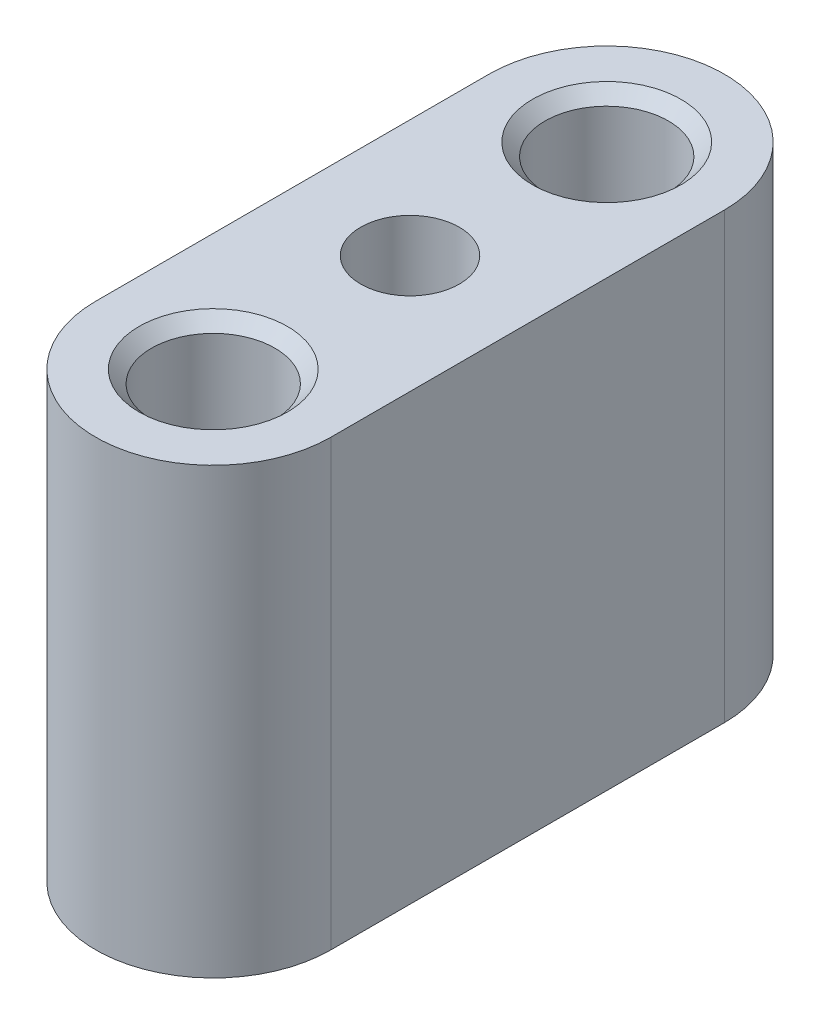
from build123d import *

# Parameters (mm, degrees)
EXTRUDE1_DEPTH            = 9
M3X0_5_TAPPED_HOLE1_D     = 2.5
M3X0_5_TAPPED_HOLE1_DEPTH = 6.5024
M3X0_5_TAPPED_HOLE1_TIP   = 0.751075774
HOLE1_D                   = 2
HOLE1_DEPTH               = 9
HOLE1_TIP                 = 0.600860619
CHAMFER1_SIZE             = 0.254


with BuildPart() as part:
    # Sketch1 → Extrude1 (new body)
    with BuildSketch(Plane(origin=(0, 0, 0), x_dir=(1, 0, 0), z_dir=(0, 1, 0))):
        with BuildLine():
            Line((-2.385, 3.9878), (-2.385, -3.9878))
            ThreePointArc((-2.385, -3.9878), (0, -6.3728), (2.385, -3.9878))
            Line((2.385, -3.9878), (2.385, 3.9878))
            ThreePointArc((2.385, 3.9878), (0, 6.3728), (-2.385, 3.9878))
        make_face()
    extrude(amount=EXTRUDE1_DEPTH)

    # M3x0.5 Tapped Hole1
    with Locations(Plane(origin=(0, 9, 0), x_dir=(1, 0, 0), z_dir=(0, 1, 0))):
        with Locations((0, -3.9878), (0, 3.9878)):
            Hole(M3X0_5_TAPPED_HOLE1_D / 2, depth=M3X0_5_TAPPED_HOLE1_DEPTH)
            with Locations((0, 0, -(M3X0_5_TAPPED_HOLE1_DEPTH + M3X0_5_TAPPED_HOLE1_TIP / 2))):  # 118° drill point
                Cone(0, M3X0_5_TAPPED_HOLE1_D / 2, M3X0_5_TAPPED_HOLE1_TIP, mode=Mode.SUBTRACT)

    # Hole1
    with Locations(Plane(origin=(0, 9, 0), x_dir=(1, 0, 0), z_dir=(0, 1, 0))):
        with Locations((0, 0)):
            Hole(HOLE1_D / 2, depth=HOLE1_DEPTH)
            with Locations((0, 0, -(HOLE1_DEPTH + HOLE1_TIP / 2))):  # 118° drill point
                Cone(0, HOLE1_D / 2, HOLE1_TIP, mode=Mode.SUBTRACT)

    # Chamfer1
    chamfer1_edges = [part.edges().sort_by_distance(p)[0] for p in [
        (1.25, 9, -3.9878),
        (1.25, 9, 3.9878),
    ]]
    chamfer(chamfer1_edges, length=CHAMFER1_SIZE)


solid = part.part
